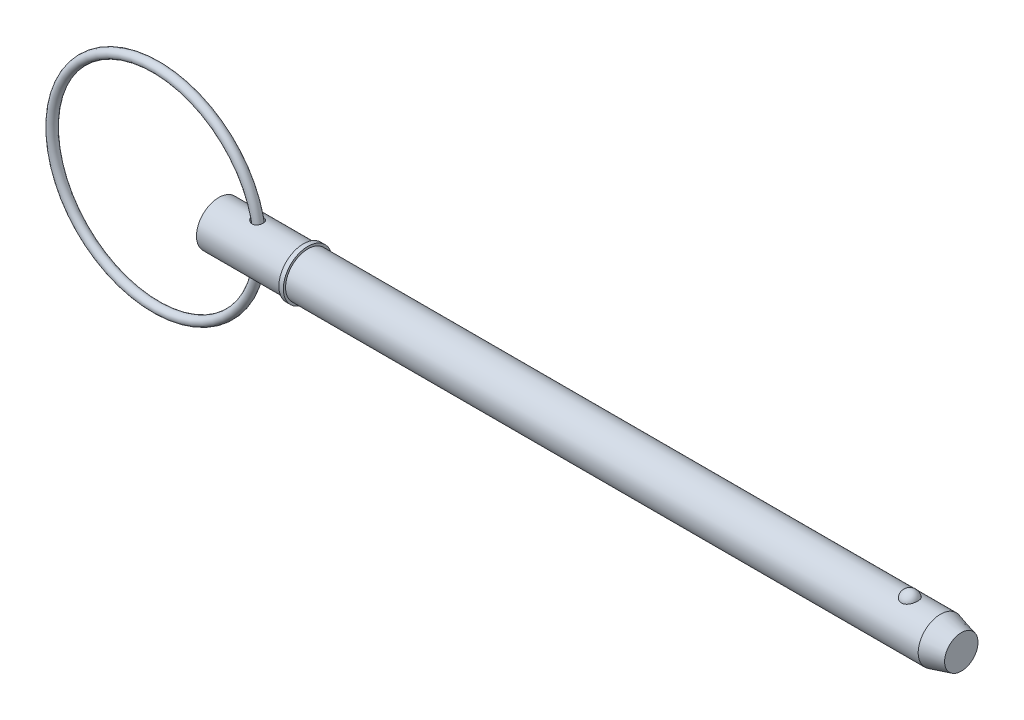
ISO-10303-21;
HEADER;
FILE_DESCRIPTION(('STEP AP214'),'2;1');
FILE_NAME('part.step','',(''),(''),'','','');
FILE_SCHEMA(('AUTOMOTIVE_DESIGN { 1 0 10303 214 1 1 1 1 }'));
ENDSEC;
DATA;
#1=APPLICATION_CONTEXT('core data for automotive mechanical design processes');
#2=APPLICATION_PROTOCOL_DEFINITION('international standard','automotive_design',2000,#1);
#3=PRODUCT_CONTEXT('',#1,'mechanical');
#4=PRODUCT('Part','Part','',(#3));
#5=PRODUCT_RELATED_PRODUCT_CATEGORY('part','',(#4));
#6=PRODUCT_DEFINITION_FORMATION('','',#4);
#7=PRODUCT_DEFINITION_CONTEXT('part definition',#1,'design');
#8=PRODUCT_DEFINITION('design','',#6,#7);
#9=PRODUCT_DEFINITION_SHAPE('','',#8);
#10=(LENGTH_UNIT() NAMED_UNIT(*) SI_UNIT(.MILLI.,.METRE.));
#11=(NAMED_UNIT(*) PLANE_ANGLE_UNIT() SI_UNIT($,.RADIAN.));
#12=(NAMED_UNIT(*) SI_UNIT($,.STERADIAN.) SOLID_ANGLE_UNIT());
#13=UNCERTAINTY_MEASURE_WITH_UNIT(LENGTH_MEASURE(1.E-05),#10,'distance_accuracy_value','');
#14=(GEOMETRIC_REPRESENTATION_CONTEXT(3) GLOBAL_UNCERTAINTY_ASSIGNED_CONTEXT((#13)) GLOBAL_UNIT_ASSIGNED_CONTEXT((#10,
#11,#12)) REPRESENTATION_CONTEXT('',''));
#15=CARTESIAN_POINT('',(0.,0.,0.));
#16=DIRECTION('',(0.,0.,1.));
#17=DIRECTION('',(1.,0.,0.));
#18=AXIS2_PLACEMENT_3D('',#15,#16,#17);
#19=CARTESIAN_POINT('',(-13.4013067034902,0.,0.));
#20=DIRECTION('',(0.,0.,1.));
#21=DIRECTION('',(1.,0.,0.));
#22=AXIS2_PLACEMENT_3D('',#19,#20,#21);
#23=TOROIDAL_SURFACE('',#22,22.225,0.952999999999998);
#24=CARTESIAN_POINT('',(9.77669329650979,0.,0.));
#25=VERTEX_POINT('',#24);
#26=VERTEX_LOOP('',#25);
#27=FACE_BOUND('',#26,.T.);
#28=ADVANCED_FACE('P0_F12',(#27),#23,.T.);
#29=CLOSED_SHELL('',(#28));
#30=MANIFOLD_SOLID_BREP('P0_B1',#29);
#31=CARTESIAN_POINT('',(0.,0.,0.));
#32=DIRECTION('',(1.,0.,0.));
#33=DIRECTION('',(0.,0.,-1.));
#34=AXIS2_PLACEMENT_3D('',#31,#32,#33);
#35=CYLINDRICAL_SURFACE('',#34,4.765);
#36=CARTESIAN_POINT('',(7.48459594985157,4.685973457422,-0.864220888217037));
#37=CARTESIAN_POINT('',(7.53849733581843,4.67711144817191,-0.912273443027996));
#38=CARTESIAN_POINT('',(7.59654891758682,4.66833039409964,-0.955745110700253));
#39=CARTESIAN_POINT('',(7.71924602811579,4.65195567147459,-1.03251233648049));
#40=CARTESIAN_POINT('',(7.78389917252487,4.64436340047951,-1.06579596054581));
#41=CARTESIAN_POINT('',(7.91808098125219,4.63129108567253,-1.12124172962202));
#42=CARTESIAN_POINT('',(7.98761280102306,4.62581242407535,-1.14339659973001));
#43=CARTESIAN_POINT('',(8.12956198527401,4.61771699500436,-1.17566870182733));
#44=CARTESIAN_POINT('',(8.20197774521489,4.61509865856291,-1.18579253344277));
#45=CARTESIAN_POINT('',(8.34550810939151,4.6131791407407,-1.19323853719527));
#46=CARTESIAN_POINT('',(8.41660306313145,4.61378793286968,-1.19090812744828));
#47=CARTESIAN_POINT('',(8.55721866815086,4.61812874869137,-1.17396277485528));
#48=CARTESIAN_POINT('',(8.62673979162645,4.62185982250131,-1.15935156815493));
#49=CARTESIAN_POINT('',(8.75801373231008,4.63172632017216,-1.11925454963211));
#50=CARTESIAN_POINT('',(8.81998342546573,4.63771186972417,-1.09443918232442));
#51=CARTESIAN_POINT('',(8.93863698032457,4.65140179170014,-1.03470792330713));
#52=CARTESIAN_POINT('',(8.99532131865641,4.65910600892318,-0.999792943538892));
#53=CARTESIAN_POINT('',(9.10080884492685,4.67519705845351,-0.921583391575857));
#54=CARTESIAN_POINT('',(9.14973848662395,4.68356861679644,-0.878455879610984));
#55=CARTESIAN_POINT('',(9.23971126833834,4.70019813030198,-0.784620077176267));
#56=CARTESIAN_POINT('',(9.28075401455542,4.7084560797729,-0.733911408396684));
#57=CARTESIAN_POINT('',(9.35441071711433,4.7240688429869,-0.62563775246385));
#58=CARTESIAN_POINT('',(9.38691359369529,4.73141115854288,-0.567995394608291));
#59=CARTESIAN_POINT('',(9.44203216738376,4.74427907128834,-0.447974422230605));
#60=CARTESIAN_POINT('',(9.46464743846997,4.74980459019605,-0.385595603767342));
#61=CARTESIAN_POINT('',(9.49961110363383,4.75848927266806,-0.257248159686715));
#62=CARTESIAN_POINT('',(9.51186382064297,4.76162635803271,-0.191251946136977));
#63=CARTESIAN_POINT('',(9.52545294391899,4.76511165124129,-0.0580729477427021));
#64=CARTESIAN_POINT('',(9.52678936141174,4.76545986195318,0.00910983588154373));
#65=CARTESIAN_POINT('',(9.51851557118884,4.76333054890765,0.142723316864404));
#66=CARTESIAN_POINT('',(9.50891008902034,4.76085424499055,0.209154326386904));
#67=CARTESIAN_POINT('',(9.47899306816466,4.75334441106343,0.339411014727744));
#68=CARTESIAN_POINT('',(9.45868126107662,4.74831081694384,0.403236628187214));
#69=CARTESIAN_POINT('',(9.4078294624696,4.73622777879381,0.526509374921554));
#70=CARTESIAN_POINT('',(9.37728413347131,4.72917728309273,0.585954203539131));
#71=CARTESIAN_POINT('',(9.30671117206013,4.71383320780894,0.698745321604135));
#72=CARTESIAN_POINT('',(9.26668347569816,4.70553961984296,0.752091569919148));
#73=CARTESIAN_POINT('',(9.17821531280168,4.68864637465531,0.851083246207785));
#74=CARTESIAN_POINT('',(9.12978756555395,4.68004719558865,0.896740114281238));
#75=CARTESIAN_POINT('',(9.02575872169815,4.66350833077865,0.97912505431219));
#76=CARTESIAN_POINT('',(8.97015856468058,4.65556855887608,1.01585429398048));
#77=CARTESIAN_POINT('',(8.85409306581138,4.6413534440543,1.0789347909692));
#78=CARTESIAN_POINT('',(8.79369898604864,4.63505812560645,1.10541268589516));
#79=CARTESIAN_POINT('',(8.66918290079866,4.62469916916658,1.1479836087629));
#80=CARTESIAN_POINT('',(8.60506121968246,4.62063533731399,1.1640775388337));
#81=CARTESIAN_POINT('',(8.47537782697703,4.61517348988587,1.18554696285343));
#82=CARTESIAN_POINT('',(8.4098281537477,4.61375835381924,1.19099130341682));
#83=CARTESIAN_POINT('',(8.2786938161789,4.61362908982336,1.19149080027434));
#84=CARTESIAN_POINT('',(8.21310914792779,4.61491539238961,1.18654430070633));
#85=CARTESIAN_POINT('',(8.08152457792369,4.62006017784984,1.16635311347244));
#86=CARTESIAN_POINT('',(8.01557748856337,4.62399895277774,1.15078675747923));
#87=CARTESIAN_POINT('',(7.88704537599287,4.63403793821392,1.10966738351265));
#88=CARTESIAN_POINT('',(7.82446148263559,4.64013886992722,1.08411103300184));
#89=CARTESIAN_POINT('',(7.70057947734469,4.65423592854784,1.02195168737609));
#90=CARTESIAN_POINT('',(7.63957197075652,4.66232221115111,0.984788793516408));
#91=CARTESIAN_POINT('',(7.52457021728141,4.67924552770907,0.900950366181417));
#92=CARTESIAN_POINT('',(7.47057819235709,4.68808279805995,0.854271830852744));
#93=CARTESIAN_POINT('',(7.37028930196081,4.70567913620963,0.751386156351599));
#94=CARTESIAN_POINT('',(7.32416327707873,4.7144333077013,0.695010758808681));
#95=CARTESIAN_POINT('',(7.24276674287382,4.73060166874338,0.574719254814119));
#96=CARTESIAN_POINT('',(7.20749051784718,4.73801656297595,0.510807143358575));
#97=CARTESIAN_POINT('',(7.15148495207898,4.75009927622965,0.381705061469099));
#98=CARTESIAN_POINT('',(7.12994463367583,4.7549169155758,0.31688231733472));
#99=CARTESIAN_POINT('',(7.09904467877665,4.76189692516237,0.184270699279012));
#100=CARTESIAN_POINT('',(7.08967554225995,4.76406136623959,0.116484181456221));
#101=CARTESIAN_POINT('',(7.08394150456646,4.76538257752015,-0.0133529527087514));
#102=CARTESIAN_POINT('',(7.0864533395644,4.76479916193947,-0.0753538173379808));
#103=CARTESIAN_POINT('',(7.10181380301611,4.76127985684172,-0.197993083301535));
#104=CARTESIAN_POINT('',(7.11466291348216,4.75834385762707,-0.258631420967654));
#105=CARTESIAN_POINT('',(7.14973937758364,4.75051877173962,-0.375744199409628));
#106=CARTESIAN_POINT('',(7.17178938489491,4.7456667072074,-0.432274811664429));
#107=CARTESIAN_POINT('',(7.22432962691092,4.73449674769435,-0.54107038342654));
#108=CARTESIAN_POINT('',(7.25481702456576,4.72817934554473,-0.593336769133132));
#109=CARTESIAN_POINT('',(7.31700895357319,4.71588241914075,-0.683642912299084));
#110=CARTESIAN_POINT('',(7.34750058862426,4.7100477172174,-0.722547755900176));
#111=CARTESIAN_POINT('',(7.41288050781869,4.69812059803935,-0.796421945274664));
#112=CARTESIAN_POINT('',(7.44776960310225,4.69202813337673,-0.831390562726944));
#113=CARTESIAN_POINT('',(7.48459594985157,4.685973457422,-0.864220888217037));
#114=B_SPLINE_CURVE_WITH_KNOTS('',3,(#36,#37,#38,#39,#40,#41,#42,#43,#44,#45,#46,#47,#48,#49,
#50,#51,#52,#53,#54,#55,#56,#57,#58,#59,#60,#61,#62,#63,#64,#65,#66,#67,#68,#69,#70,#71,#72,#73,
#74,#75,#76,#77,#78,#79,#80,#81,#82,#83,#84,#85,#86,#87,#88,#89,#90,#91,#92,#93,#94,#95,#96,#97,
#98,#99,#100,#101,#102,#103,#104,#105,#106,#107,#108,#109,#110,#111,#112,#113),.UNSPECIFIED.,
.T.,.F.,(4,2,2,2,2,2,2,2,2,2,2,2,2,2,2,2,2,2,2,2,2,2,2,2,2,2,2,2,2,2,2,2,2,2,2,2,2,2,4),(0.,
0.218078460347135,0.436411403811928,0.654886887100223,0.873242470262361,1.08553925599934,
1.2977714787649,1.49785367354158,1.6979178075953,1.8942789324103,2.09064985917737,
2.28946102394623,2.48828075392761,2.68891673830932,2.88955251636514,3.09010167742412,
3.29065586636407,3.49131482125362,3.69197512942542,3.89233421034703,4.09266707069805,
4.29043955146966,4.48819484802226,4.68466743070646,4.8811713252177,5.08390806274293,
5.28671248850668,5.50140943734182,5.71617422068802,5.93513249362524,6.15397522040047,
6.35827356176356,6.56241234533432,6.74765856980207,6.93291343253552,7.11475139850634,
7.29652829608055,7.44549570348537,7.59449062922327),.UNSPECIFIED.);
#115=CARTESIAN_POINT('',(7.48459594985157,4.685973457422,-0.864220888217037));
#116=VERTEX_POINT('',#115);
#117=EDGE_CURVE('P1_E42',#116,#116,#114,.T.);
#118=ORIENTED_EDGE('',*,*,#117,.T.);
#119=EDGE_LOOP('',(#118));
#120=FACE_BOUND('',#119,.T.);
#121=CARTESIAN_POINT('',(0.,0.,0.));
#122=DIRECTION('',(1.,0.,0.));
#123=DIRECTION('',(0.,0.,-1.));
#124=AXIS2_PLACEMENT_3D('',#121,#122,#123);
#125=CIRCLE('',#124,4.765);
#126=CARTESIAN_POINT('',(0.,0.,-4.765));
#127=VERTEX_POINT('',#126);
#128=EDGE_CURVE('P1_E9',#127,#127,#125,.T.);
#129=ORIENTED_EDGE('',*,*,#128,.T.);
#130=EDGE_LOOP('',(#129));
#131=FACE_BOUND('',#130,.T.);
#132=CARTESIAN_POINT('',(18.097,0.,0.));
#133=DIRECTION('',(1.,0.,0.));
#134=DIRECTION('',(0.,0.,-1.));
#135=AXIS2_PLACEMENT_3D('',#132,#133,#134);
#136=CIRCLE('',#135,4.765);
#137=CARTESIAN_POINT('',(18.097,0.,-4.765));
#138=VERTEX_POINT('',#137);
#139=EDGE_CURVE('P1_E25',#138,#138,#136,.T.);
#140=ORIENTED_EDGE('',*,*,#139,.F.);
#141=EDGE_LOOP('',(#140));
#142=FACE_BOUND('',#141,.T.);
#143=CARTESIAN_POINT('',(7.48459594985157,-4.685973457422,-0.864220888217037));
#144=CARTESIAN_POINT('',(7.43440944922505,-4.6942250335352,-0.819477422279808));
#145=CARTESIAN_POINT('',(7.38778663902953,-4.70255210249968,-0.77073361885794));
#146=CARTESIAN_POINT('',(7.3030968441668,-4.7184989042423,-0.666172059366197));
#147=CARTESIAN_POINT('',(7.26503010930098,-4.72611861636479,-0.610354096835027));
#148=CARTESIAN_POINT('',(7.19878266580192,-4.73983819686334,-0.492624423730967));
#149=CARTESIAN_POINT('',(7.17064194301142,-4.74593188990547,-0.430689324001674));
#150=CARTESIAN_POINT('',(7.12584349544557,-4.75581281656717,-0.3026233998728));
#151=CARTESIAN_POINT('',(7.10917889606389,-4.75960143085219,-0.236495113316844));
#152=CARTESIAN_POINT('',(7.0889853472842,-4.76421379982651,-0.106818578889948));
#153=CARTESIAN_POINT('',(7.0846333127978,-4.76522320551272,-0.0434047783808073));
#154=CARTESIAN_POINT('',(7.08693064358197,-4.7646936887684,0.0832041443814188));
#155=CARTESIAN_POINT('',(7.09357756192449,-4.76315533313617,0.146399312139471));
#156=CARTESIAN_POINT('',(7.11694629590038,-4.75784365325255,0.267709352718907));
#157=CARTESIAN_POINT('',(7.13318365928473,-4.75417793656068,0.325923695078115));
#158=CARTESIAN_POINT('',(7.17459606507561,-4.74508048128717,0.438922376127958));
#159=CARTESIAN_POINT('',(7.19977257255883,-4.73964845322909,0.493706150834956));
#160=CARTESIAN_POINT('',(7.25946789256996,-4.72725615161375,0.60111049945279));
#161=CARTESIAN_POINT('',(7.2943661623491,-4.72023663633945,0.653512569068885));
#162=CARTESIAN_POINT('',(7.37173226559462,-4.70550732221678,0.752279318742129));
#163=CARTESIAN_POINT('',(7.41420315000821,-4.69779724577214,0.798641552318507));
#164=CARTESIAN_POINT('',(7.50982312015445,-4.6816641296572,0.888551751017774));
#165=CARTESIAN_POINT('',(7.56359853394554,-4.67324162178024,0.931434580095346));
#166=CARTESIAN_POINT('',(7.67736628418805,-4.65728554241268,1.00819498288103));
#167=CARTESIAN_POINT('',(7.7373611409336,-4.64975233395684,1.04206888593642));
#168=CARTESIAN_POINT('',(7.86574076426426,-4.63599923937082,1.10169445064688));
#169=CARTESIAN_POINT('',(7.93441048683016,-4.62988111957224,1.12685968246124));
#170=CARTESIAN_POINT('',(8.07519000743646,-4.62035710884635,1.16529928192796));
#171=CARTESIAN_POINT('',(8.14729925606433,-4.61695078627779,1.1785755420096));
#172=CARTESIAN_POINT('',(8.29111621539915,-4.61341807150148,1.19232949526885));
#173=CARTESIAN_POINT('',(8.36279361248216,-4.61321655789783,1.19310032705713));
#174=CARTESIAN_POINT('',(8.50512944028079,-4.61602317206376,1.1821962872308));
#175=CARTESIAN_POINT('',(8.57578827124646,-4.61903000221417,1.17052644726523));
#176=CARTESIAN_POINT('',(8.70965757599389,-4.62766311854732,1.13589249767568));
#177=CARTESIAN_POINT('',(8.77306169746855,-4.63312492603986,1.11363308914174));
#178=CARTESIAN_POINT('',(8.8949702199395,-4.64598463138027,1.05869880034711));
#179=CARTESIAN_POINT('',(8.95347516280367,-4.65338231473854,1.02602507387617));
#180=CARTESIAN_POINT('',(9.06253415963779,-4.66906009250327,0.952097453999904));
#181=CARTESIAN_POINT('',(9.11324728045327,-4.67731427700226,0.911072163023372));
#182=CARTESIAN_POINT('',(9.20707850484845,-4.69393979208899,0.821122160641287));
#183=CARTESIAN_POINT('',(9.25019629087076,-4.70231112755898,0.772197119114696));
#184=CARTESIAN_POINT('',(9.32819072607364,-4.71835356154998,0.667239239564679));
#185=CARTESIAN_POINT('',(9.36297449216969,-4.72601623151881,0.611136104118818));
#186=CARTESIAN_POINT('',(9.42286382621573,-4.73971239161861,0.493799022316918));
#187=CARTESIAN_POINT('',(9.44796891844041,-4.74574580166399,0.432564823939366));
#188=CARTESIAN_POINT('',(9.48811605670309,-4.75559286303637,0.305990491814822));
#189=CARTESIAN_POINT('',(9.50304870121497,-4.75938232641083,0.240613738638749));
#190=CARTESIAN_POINT('',(9.5220569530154,-4.76423188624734,0.108201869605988));
#191=CARTESIAN_POINT('',(9.52613255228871,-4.76529198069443,0.0411667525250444));
#192=CARTESIAN_POINT('',(9.52332772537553,-4.76456884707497,-0.0926701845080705));
#193=CARTESIAN_POINT('',(9.51644541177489,-4.76278512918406,-0.159471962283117));
#194=CARTESIAN_POINT('',(9.49188827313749,-4.75656536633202,-0.290934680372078));
#195=CARTESIAN_POINT('',(9.47421322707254,-4.75212926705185,-0.355595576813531));
#196=CARTESIAN_POINT('',(9.42849503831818,-4.74108318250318,-0.480955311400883));
#197=CARTESIAN_POINT('',(9.4004503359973,-4.73447287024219,-0.541653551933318));
#198=CARTESIAN_POINT('',(9.33467290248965,-4.71979928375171,-0.657361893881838));
#199=CARTESIAN_POINT('',(9.29694000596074,-4.71173598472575,-0.712371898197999));
#200=CARTESIAN_POINT('',(9.2127449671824,-4.69505469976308,-0.815106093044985));
#201=CARTESIAN_POINT('',(9.1662875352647,-4.68643701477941,-0.862834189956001));
#202=CARTESIAN_POINT('',(9.06584125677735,-4.66961864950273,-0.949656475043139));
#203=CARTESIAN_POINT('',(9.01185326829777,-4.66141792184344,-0.98875164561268));
#204=CARTESIAN_POINT('',(8.8985010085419,-4.64646376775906,-1.0567894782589));
#205=CARTESIAN_POINT('',(8.83920621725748,-4.63969468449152,-1.08584444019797));
#206=CARTESIAN_POINT('',(8.71642097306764,-4.62824519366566,-1.13365785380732));
#207=CARTESIAN_POINT('',(8.65293102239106,-4.623564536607,-1.15241753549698));
#208=CARTESIAN_POINT('',(8.52421291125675,-4.61681938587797,-1.17914952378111));
#209=CARTESIAN_POINT('',(8.45900634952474,-4.6147310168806,-1.18722032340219));
#210=CARTESIAN_POINT('',(8.32811210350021,-4.61325848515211,-1.19292878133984));
#211=CARTESIAN_POINT('',(8.26242433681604,-4.61387479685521,-1.19056460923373));
#212=CARTESIAN_POINT('',(8.13057358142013,-4.6177227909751,-1.17555160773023));
#213=CARTESIAN_POINT('',(8.06444352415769,-4.62102282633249,-1.16263394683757));
#214=CARTESIAN_POINT('',(7.93513143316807,-4.62989870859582,-1.12676570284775));
#215=CARTESIAN_POINT('',(7.87194976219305,-4.6354748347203,-1.10381388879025));
#216=CARTESIAN_POINT('',(7.75155849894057,-4.64811746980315,-1.04928030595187));
#217=CARTESIAN_POINT('',(7.69423767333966,-4.65514232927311,-1.01793362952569));
#218=CARTESIAN_POINT('',(7.58503138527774,-4.67007903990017,-0.947046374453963));
#219=CARTESIAN_POINT('',(7.53314612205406,-4.67799092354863,-0.907505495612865));
#220=CARTESIAN_POINT('',(7.48459594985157,-4.685973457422,-0.864220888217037));
#221=B_SPLINE_CURVE_WITH_KNOTS('',3,(#143,#144,#145,#146,#147,#148,#149,#150,#151,#152,#153,
#154,#155,#156,#157,#158,#159,#160,#161,#162,#163,#164,#165,#166,#167,#168,#169,#170,#171,#172,
#173,#174,#175,#176,#177,#178,#179,#180,#181,#182,#183,#184,#185,#186,#187,#188,#189,#190,#191,
#192,#193,#194,#195,#196,#197,#198,#199,#200,#201,#202,#203,#204,#205,#206,#207,#208,#209,#210,
#211,#212,#213,#214,#215,#216,#217,#218,#219,#220),.UNSPECIFIED.,.T.,.F.,(4,2,2,2,2,2,2,2,2,2,2,
2,2,2,2,2,2,2,2,2,2,2,2,2,2,2,2,2,2,2,2,2,2,2,2,2,2,2,4),(0.,0.203013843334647,
0.406033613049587,0.609862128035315,0.813568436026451,1.0032929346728,1.19297523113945,
1.37380897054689,1.55467236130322,1.74393241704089,1.93326889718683,2.14025373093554,
2.3473227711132,2.566425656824,2.78549366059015,2.9994188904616,3.21325763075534,
3.41451842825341,3.61575693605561,3.81208930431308,4.00842987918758,4.20686629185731,
4.40531245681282,4.60586051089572,4.80640871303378,5.0069914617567,5.20757831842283,
5.40819535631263,5.60881581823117,5.80932827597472,6.00981790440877,6.2079863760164,
6.40613116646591,6.60243714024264,6.79877754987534,7.00028133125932,7.20180983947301,
7.39819723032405,7.59459181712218),.UNSPECIFIED.);
#222=CARTESIAN_POINT('',(7.48459594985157,-4.685973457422,-0.864220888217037));
#223=VERTEX_POINT('',#222);
#224=EDGE_CURVE('P1_E17',#223,#223,#221,.T.);
#225=ORIENTED_EDGE('',*,*,#224,.T.);
#226=EDGE_LOOP('',(#225));
#227=FACE_BOUND('',#226,.T.);
#228=ADVANCED_FACE('P1_F13',(#120,#131,#142,#227),#35,.T.);
#229=CARTESIAN_POINT('',(0.,0.,0.));
#230=DIRECTION('',(1.,0.,0.));
#231=DIRECTION('',(0.,0.,-1.));
#232=AXIS2_PLACEMENT_3D('',#229,#230,#231);
#233=CYLINDRICAL_SURFACE('',#232,4.765);
#234=CARTESIAN_POINT('',(154.304194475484,0.,0.));
#235=DIRECTION('',(1.,0.,0.));
#236=DIRECTION('',(0.,0.,-1.));
#237=AXIS2_PLACEMENT_3D('',#234,#235,#236);
#238=CIRCLE('',#237,4.765);
#239=CARTESIAN_POINT('',(154.304194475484,0.,-4.765));
#240=VERTEX_POINT('',#239);
#241=EDGE_CURVE('P1_E99',#240,#240,#238,.T.);
#242=ORIENTED_EDGE('',*,*,#241,.F.);
#243=EDGE_LOOP('',(#242));
#244=FACE_BOUND('',#243,.T.);
#245=CARTESIAN_POINT('',(19.05,0.,0.));
#246=DIRECTION('',(1.,0.,0.));
#247=DIRECTION('',(0.,0.,-1.));
#248=AXIS2_PLACEMENT_3D('',#245,#246,#247);
#249=CIRCLE('',#248,4.765);
#250=CARTESIAN_POINT('',(19.05,0.,-4.765));
#251=VERTEX_POINT('',#250);
#252=EDGE_CURVE('P1_E96',#251,#251,#249,.T.);
#253=ORIENTED_EDGE('',*,*,#252,.T.);
#254=EDGE_LOOP('',(#253));
#255=FACE_BOUND('',#254,.T.);
#256=CARTESIAN_POINT('',(147.751020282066,4.42764777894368,1.76101111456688));
#257=CARTESIAN_POINT('',(147.659721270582,4.42764470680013,1.76101422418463));
#258=CARTESIAN_POINT('',(147.568446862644,4.43059091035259,1.75366340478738));
#259=CARTESIAN_POINT('',(147.388615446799,4.44201846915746,1.72451180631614));
#260=CARTESIAN_POINT('',(147.300057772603,4.45049845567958,1.70271460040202));
#261=CARTESIAN_POINT('',(147.128257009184,4.47200516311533,1.64539370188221));
#262=CARTESIAN_POINT('',(147.045006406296,4.48502527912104,1.60988994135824));
#263=CARTESIAN_POINT('',(146.885763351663,4.51419542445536,1.52617873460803));
#264=CARTESIAN_POINT('',(146.809772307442,4.53034605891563,1.47796883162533));
#265=CARTESIAN_POINT('',(146.664744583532,4.56459317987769,1.36860494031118));
#266=CARTESIAN_POINT('',(146.595964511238,4.58273170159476,1.30712420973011));
#267=CARTESIAN_POINT('',(146.469342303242,4.61870302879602,1.17370204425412));
#268=CARTESIAN_POINT('',(146.411502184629,4.63653577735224,1.10175868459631));
#269=CARTESIAN_POINT('',(146.305570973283,4.67090140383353,0.945806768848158));
#270=CARTESIAN_POINT('',(146.258030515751,4.68734068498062,0.861402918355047));
#271=CARTESIAN_POINT('',(146.177081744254,4.71628466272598,0.685442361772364));
#272=CARTESIAN_POINT('',(146.143674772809,4.72878898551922,0.593884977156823));
#273=CARTESIAN_POINT('',(146.091287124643,4.74874061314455,0.404781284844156));
#274=CARTESIAN_POINT('',(146.072517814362,4.75611366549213,0.3071684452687));
#275=CARTESIAN_POINT('',(146.050584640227,4.76475393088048,0.109940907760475));
#276=CARTESIAN_POINT('',(146.047420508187,4.76602124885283,0.0103262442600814));
#277=CARTESIAN_POINT('',(146.056740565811,4.76232928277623,-0.187629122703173));
#278=CARTESIAN_POINT('',(146.069158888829,4.7573962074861,-0.285973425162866));
#279=CARTESIAN_POINT('',(146.109280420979,4.74184975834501,-0.479027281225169));
#280=CARTESIAN_POINT('',(146.136983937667,4.7312362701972,-0.573736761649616));
#281=CARTESIAN_POINT('',(146.207158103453,4.70540026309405,-0.756973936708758));
#282=CARTESIAN_POINT('',(146.249646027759,4.69017235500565,-0.845494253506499));
#283=CARTESIAN_POINT('',(146.348520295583,4.6566986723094,-1.01378033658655));
#284=CARTESIAN_POINT('',(146.404907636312,4.63845268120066,-1.09354547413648));
#285=CARTESIAN_POINT('',(146.530552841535,4.60085438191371,-1.24228523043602));
#286=CARTESIAN_POINT('',(146.599843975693,4.58149930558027,-1.31123108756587));
#287=CARTESIAN_POINT('',(146.749606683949,4.54391653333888,-1.43607409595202));
#288=CARTESIAN_POINT('',(146.830077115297,4.52568872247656,-1.49197257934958));
#289=CARTESIAN_POINT('',(146.998150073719,4.49293007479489,-1.58786764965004));
#290=CARTESIAN_POINT('',(147.085544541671,4.47832346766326,-1.62820219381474));
#291=CARTESIAN_POINT('',(147.266553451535,4.45406011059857,-1.69345757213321));
#292=CARTESIAN_POINT('',(147.36016555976,4.44440151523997,-1.71838415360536));
#293=CARTESIAN_POINT('',(147.545893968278,4.43159888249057,-1.75112843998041));
#294=CARTESIAN_POINT('',(147.637849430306,4.42815213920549,-1.75974223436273));
#295=CARTESIAN_POINT('',(147.821965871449,4.427247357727,-1.76201865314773));
#296=CARTESIAN_POINT('',(147.914126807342,4.42978816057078,-1.7556841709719));
#297=CARTESIAN_POINT('',(148.093129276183,4.44038648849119,-1.72869560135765));
#298=CARTESIAN_POINT('',(148.180047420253,4.44827555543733,-1.70847853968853));
#299=CARTESIAN_POINT('',(148.349131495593,4.46852246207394,-1.65479562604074));
#300=CARTESIAN_POINT('',(148.431297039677,4.48088066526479,-1.62132869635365));
#301=CARTESIAN_POINT('',(148.590591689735,4.50907357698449,-1.54120560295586));
#302=CARTESIAN_POINT('',(148.667570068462,4.52497884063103,-1.49427526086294));
#303=CARTESIAN_POINT('',(148.812708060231,4.55845148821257,-1.38881222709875));
#304=CARTESIAN_POINT('',(148.880865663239,4.57601924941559,-1.33027689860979));
#305=CARTESIAN_POINT('',(149.010099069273,4.61196537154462,-1.19991049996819));
#306=CARTESIAN_POINT('',(149.070656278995,4.63034074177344,-1.12756415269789));
#307=CARTESIAN_POINT('',(149.179279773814,4.66513959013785,-0.973612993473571));
#308=CARTESIAN_POINT('',(149.227343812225,4.68156271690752,-0.89200652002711));
#309=CARTESIAN_POINT('',(149.311383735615,4.71130224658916,-0.718892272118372));
#310=CARTESIAN_POINT('',(149.346918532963,4.724501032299,-0.627149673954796));
#311=CARTESIAN_POINT('',(149.402952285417,4.74571823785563,-0.43861154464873));
#312=CARTESIAN_POINT('',(149.423450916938,4.75373654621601,-0.341815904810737));
#313=CARTESIAN_POINT('',(149.449033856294,4.76378905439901,-0.145633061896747));
#314=CARTESIAN_POINT('',(149.454076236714,4.76580697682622,-0.0462395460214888));
#315=CARTESIAN_POINT('',(149.448523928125,4.7636057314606,0.152038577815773));
#316=CARTESIAN_POINT('',(149.437929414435,4.75938663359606,0.250923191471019));
#317=CARTESIAN_POINT('',(149.401387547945,4.74516937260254,0.445004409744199));
#318=CARTESIAN_POINT('',(149.375496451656,4.73519238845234,0.540213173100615));
#319=CARTESIAN_POINT('',(149.308927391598,4.71049394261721,0.724662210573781));
#320=CARTESIAN_POINT('',(149.268248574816,4.69577220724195,0.813902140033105));
#321=CARTESIAN_POINT('',(149.172717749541,4.66303767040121,0.984313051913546));
#322=CARTESIAN_POINT('',(149.117804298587,4.64501070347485,1.06544688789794));
#323=CARTESIAN_POINT('',(148.995049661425,4.60764678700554,1.21692673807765));
#324=CARTESIAN_POINT('',(148.927208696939,4.58830985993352,1.28727293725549));
#325=CARTESIAN_POINT('',(148.780548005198,4.55060370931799,1.41479271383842));
#326=CARTESIAN_POINT('',(148.701791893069,4.53222967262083,1.4720378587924));
#327=CARTESIAN_POINT('',(148.534989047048,4.49849576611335,1.57212016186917));
#328=CARTESIAN_POINT('',(148.446941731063,4.48313608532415,1.6149564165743));
#329=CARTESIAN_POINT('',(148.259791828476,4.45676184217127,1.68642657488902));
#330=CARTESIAN_POINT('',(148.160365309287,4.44598302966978,1.71430590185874));
#331=CARTESIAN_POINT('',(147.957621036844,4.43142918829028,1.7515925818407));
#332=CARTESIAN_POINT('',(147.854304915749,4.42765125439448,1.76100759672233));
#333=CARTESIAN_POINT('',(147.751020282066,4.42764777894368,1.76101111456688));
#334=B_SPLINE_CURVE_WITH_KNOTS('',3,(#256,#257,#258,#259,#260,#261,#262,#263,#264,#265,#266,
#267,#268,#269,#270,#271,#272,#273,#274,#275,#276,#277,#278,#279,#280,#281,#282,#283,#284,#285,
#286,#287,#288,#289,#290,#291,#292,#293,#294,#295,#296,#297,#298,#299,#300,#301,#302,#303,#304,
#305,#306,#307,#308,#309,#310,#311,#312,#313,#314,#315,#316,#317,#318,#319,#320,#321,#322,#323,
#324,#325,#326,#327,#328,#329,#330,#331,#332,#333),.UNSPECIFIED.,.T.,.F.,(4,2,2,2,2,2,2,2,2,2,2,
2,2,2,2,2,2,2,2,2,2,2,2,2,2,2,2,2,2,2,2,2,2,2,2,2,2,2,4),(0.,0.273517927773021,
0.546968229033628,0.820022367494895,1.09312934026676,1.37393946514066,1.6548013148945,
1.94820420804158,2.24163496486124,2.53922817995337,2.83681628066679,3.13315071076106,
3.42949110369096,3.72617893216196,4.02288805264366,4.32037303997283,4.61782764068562,
4.90840095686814,5.19886582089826,5.47474855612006,5.75057789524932,6.0180997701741,
6.28564340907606,6.55907787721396,6.83257454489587,7.11962987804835,7.40673679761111,
7.70312663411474,7.99952284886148,8.29672237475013,8.59391856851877,8.89002850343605,
9.18615552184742,9.48358266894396,9.7810047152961,10.0767610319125,10.3725358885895,
10.6820893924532,10.991514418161),.UNSPECIFIED.);
#335=CARTESIAN_POINT('',(147.751020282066,4.42764777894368,1.76101111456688));
#336=VERTEX_POINT('',#335);
#337=EDGE_CURVE('P1_E34',#336,#336,#334,.T.);
#338=ORIENTED_EDGE('',*,*,#337,.T.);
#339=EDGE_LOOP('',(#338));
#340=FACE_BOUND('',#339,.T.);
#341=ADVANCED_FACE('P1_F46',(#244,#255,#340),#233,.T.);
#342=CARTESIAN_POINT('',(0.,0.,0.));
#343=DIRECTION('',(-1.,0.,0.));
#344=DIRECTION('',(0.,0.,1.));
#345=AXIS2_PLACEMENT_3D('',#342,#343,#344);
#346=PLANE('',#345);
#347=ORIENTED_EDGE('',*,*,#128,.F.);
#348=EDGE_LOOP('',(#347));
#349=FACE_BOUND('',#348,.T.);
#350=ADVANCED_FACE('P1_F15',(#349),#346,.T.);
#351=CARTESIAN_POINT('',(18.097,4.765,0.));
#352=DIRECTION('',(-1.,0.,0.));
#353=DIRECTION('',(0.,0.,1.));
#354=AXIS2_PLACEMENT_3D('',#351,#352,#353);
#355=PLANE('',#354);
#356=ORIENTED_EDGE('',*,*,#139,.T.);
#357=EDGE_LOOP('',(#356));
#358=FACE_BOUND('',#357,.T.);
#359=CARTESIAN_POINT('',(18.097,0.,0.));
#360=DIRECTION('',(1.,0.,0.));
#361=DIRECTION('',(0.,0.,-1.));
#362=AXIS2_PLACEMENT_3D('',#359,#360,#361);
#363=CIRCLE('',#362,5.2415);
#364=CARTESIAN_POINT('',(18.097,0.,-5.2415));
#365=VERTEX_POINT('',#364);
#366=EDGE_CURVE('P1_E30',#365,#365,#363,.T.);
#367=ORIENTED_EDGE('',*,*,#366,.F.);
#368=EDGE_LOOP('',(#367));
#369=FACE_BOUND('',#368,.T.);
#370=ADVANCED_FACE('P1_F81',(#358,#369),#355,.T.);
#371=CARTESIAN_POINT('',(0.,0.,0.));
#372=DIRECTION('',(1.,0.,0.));
#373=DIRECTION('',(0.,0.,-1.));
#374=AXIS2_PLACEMENT_3D('',#371,#372,#373);
#375=CYLINDRICAL_SURFACE('',#374,5.2415);
#376=ORIENTED_EDGE('',*,*,#366,.T.);
#377=EDGE_LOOP('',(#376));
#378=FACE_BOUND('',#377,.T.);
#379=CARTESIAN_POINT('',(19.05,0.,0.));
#380=DIRECTION('',(1.,0.,0.));
#381=DIRECTION('',(0.,0.,-1.));
#382=AXIS2_PLACEMENT_3D('',#379,#380,#381);
#383=CIRCLE('',#382,5.2415);
#384=CARTESIAN_POINT('',(19.05,0.,-5.2415));
#385=VERTEX_POINT('',#384);
#386=EDGE_CURVE('P1_E95',#385,#385,#383,.T.);
#387=ORIENTED_EDGE('',*,*,#386,.F.);
#388=EDGE_LOOP('',(#387));
#389=FACE_BOUND('',#388,.T.);
#390=ADVANCED_FACE('P1_F68',(#378,#389),#375,.T.);
#391=CARTESIAN_POINT('',(19.05,5.2415,0.));
#392=DIRECTION('',(1.,0.,0.));
#393=DIRECTION('',(0.,0.,-1.));
#394=AXIS2_PLACEMENT_3D('',#391,#392,#393);
#395=PLANE('',#394);
#396=ORIENTED_EDGE('',*,*,#386,.T.);
#397=EDGE_LOOP('',(#396));
#398=FACE_BOUND('',#397,.T.);
#399=ORIENTED_EDGE('',*,*,#252,.F.);
#400=EDGE_LOOP('',(#399));
#401=FACE_BOUND('',#400,.T.);
#402=ADVANCED_FACE('P1_F62',(#398,#401),#395,.T.);
#403=CARTESIAN_POINT('',(158.75,0.,0.));
#404=DIRECTION('',(-1.,0.,0.));
#405=DIRECTION('',(0.,0.,1.));
#406=AXIS2_PLACEMENT_3D('',#403,#404,#405);
#407=CONICAL_SURFACE('',#406,3.57375000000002,0.261799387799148);
#408=ORIENTED_EDGE('',*,*,#241,.T.);
#409=EDGE_LOOP('',(#408));
#410=FACE_BOUND('',#409,.T.);
#411=CARTESIAN_POINT('',(158.75,0.,0.));
#412=DIRECTION('',(1.,0.,0.));
#413=DIRECTION('',(0.,0.,-1.));
#414=AXIS2_PLACEMENT_3D('',#411,#412,#413);
#415=CIRCLE('',#414,3.57375000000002);
#416=CARTESIAN_POINT('',(158.75,0.,-3.57375000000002));
#417=VERTEX_POINT('',#416);
#418=EDGE_CURVE('P1_E41',#417,#417,#415,.T.);
#419=ORIENTED_EDGE('',*,*,#418,.F.);
#420=EDGE_LOOP('',(#419));
#421=FACE_BOUND('',#420,.T.);
#422=ADVANCED_FACE('P1_F59',(#410,#421),#407,.T.);
#423=CARTESIAN_POINT('',(158.75,3.57375000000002,0.));
#424=DIRECTION('',(1.,0.,0.));
#425=DIRECTION('',(0.,0.,-1.));
#426=AXIS2_PLACEMENT_3D('',#423,#424,#425);
#427=PLANE('',#426);
#428=ORIENTED_EDGE('',*,*,#418,.T.);
#429=EDGE_LOOP('',(#428));
#430=FACE_BOUND('',#429,.T.);
#431=ADVANCED_FACE('P1_F55',(#430),#427,.T.);
#432=CARTESIAN_POINT('',(147.751020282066,4.28849999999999,0.));
#433=DIRECTION('',(-1.,0.,0.));
#434=DIRECTION('',(0.,1.,0.));
#435=AXIS2_PLACEMENT_3D('',#432,#433,#434);
#436=SPHERICAL_SURFACE('',#435,1.7665);
#437=ORIENTED_EDGE('',*,*,#337,.F.);
#438=EDGE_LOOP('',(#437));
#439=FACE_BOUND('',#438,.T.);
#440=ADVANCED_FACE('P1_F50',(#439),#436,.T.);
#441=CARTESIAN_POINT('',(-13.4013067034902,0.,0.));
#442=DIRECTION('',(0.,0.,1.));
#443=DIRECTION('',(1.,0.,0.));
#444=AXIS2_PLACEMENT_3D('',#441,#442,#443);
#445=TOROIDAL_SURFACE('',#444,22.225,1.19125);
#446=ORIENTED_EDGE('',*,*,#224,.F.);
#447=EDGE_LOOP('',(#446));
#448=FACE_BOUND('',#447,.T.);
#449=ORIENTED_EDGE('',*,*,#117,.F.);
#450=EDGE_LOOP('',(#449));
#451=FACE_BOUND('',#450,.T.);
#452=ADVANCED_FACE('P1_F54',(#448,#451),#445,.F.);
#453=CLOSED_SHELL('',(#228,#341,#350,#370,#390,#402,#422,#431,#440,#452));
#454=MANIFOLD_SOLID_BREP('P1_B1',#453);
#455=ADVANCED_BREP_SHAPE_REPRESENTATION('',(#18,#30,#454),#14);
#456=SHAPE_DEFINITION_REPRESENTATION(#9,#455);
ENDSEC;
END-ISO-10303-21;
